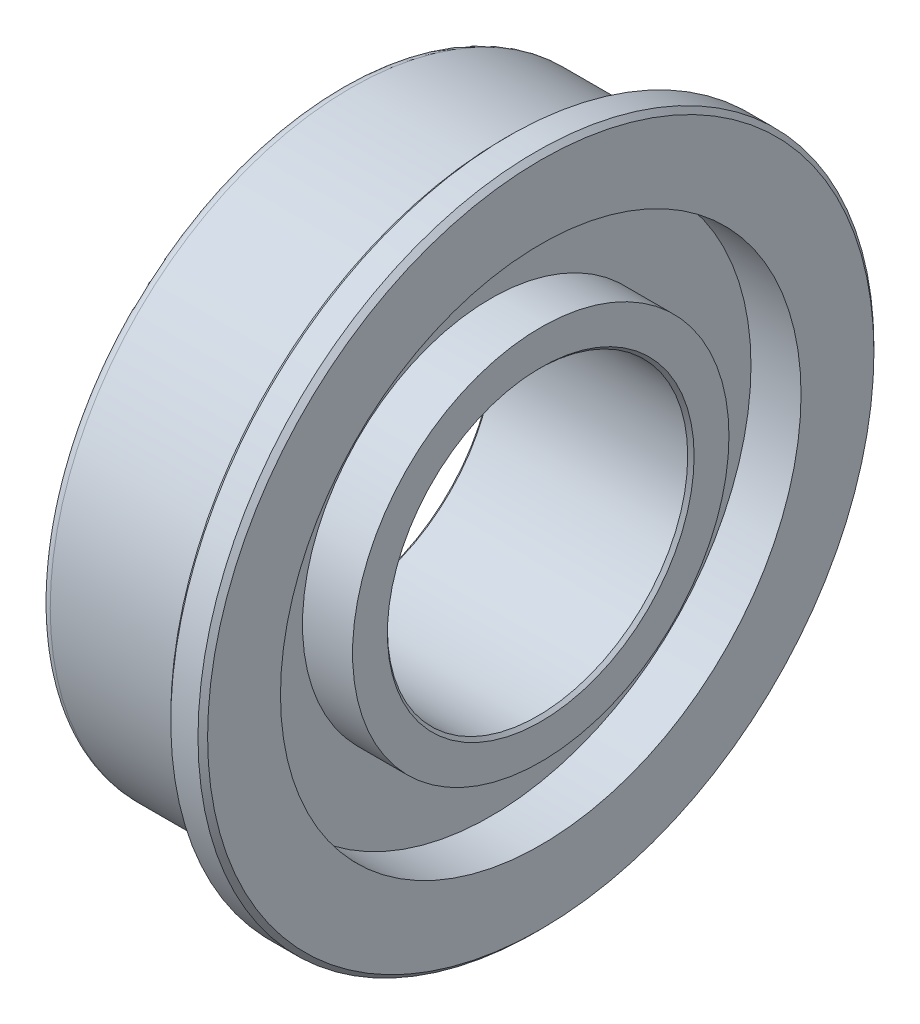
ISO-10303-21;
HEADER;
FILE_DESCRIPTION(('STEP AP214'),'2;1');
FILE_NAME('part.step','',(''),(''),'','','');
FILE_SCHEMA(('AUTOMOTIVE_DESIGN { 1 0 10303 214 1 1 1 1 }'));
ENDSEC;
DATA;
#1=APPLICATION_CONTEXT('core data for automotive mechanical design processes');
#2=APPLICATION_PROTOCOL_DEFINITION('international standard','automotive_design',2000,#1);
#3=PRODUCT_CONTEXT('',#1,'mechanical');
#4=PRODUCT('Part','Part','',(#3));
#5=PRODUCT_RELATED_PRODUCT_CATEGORY('part','',(#4));
#6=PRODUCT_DEFINITION_FORMATION('','',#4);
#7=PRODUCT_DEFINITION_CONTEXT('part definition',#1,'design');
#8=PRODUCT_DEFINITION('design','',#6,#7);
#9=PRODUCT_DEFINITION_SHAPE('','',#8);
#10=(LENGTH_UNIT() NAMED_UNIT(*) SI_UNIT(.MILLI.,.METRE.));
#11=(NAMED_UNIT(*) PLANE_ANGLE_UNIT() SI_UNIT($,.RADIAN.));
#12=(NAMED_UNIT(*) SI_UNIT($,.STERADIAN.) SOLID_ANGLE_UNIT());
#13=UNCERTAINTY_MEASURE_WITH_UNIT(LENGTH_MEASURE(1.E-05),#10,'distance_accuracy_value','');
#14=(GEOMETRIC_REPRESENTATION_CONTEXT(3) GLOBAL_UNCERTAINTY_ASSIGNED_CONTEXT((#13)) GLOBAL_UNIT_ASSIGNED_CONTEXT((#10,
#11,#12)) REPRESENTATION_CONTEXT('',''));
#15=CARTESIAN_POINT('',(0.,0.,0.));
#16=DIRECTION('',(0.,0.,1.));
#17=DIRECTION('',(1.,0.,0.));
#18=AXIS2_PLACEMENT_3D('',#15,#16,#17);
#19=CARTESIAN_POINT('',(1.5875,0.,0.));
#20=DIRECTION('',(1.,0.,0.));
#21=DIRECTION('',(0.,0.,-0.999999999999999));
#22=AXIS2_PLACEMENT_3D('',#19,#20,#21);
#23=PLANE('',#22);
#24=CARTESIAN_POINT('',(1.5875,0.,0.));
#25=DIRECTION('',(1.,0.,0.));
#26=DIRECTION('',(0.,0.,-0.999999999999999));
#27=AXIS2_PLACEMENT_3D('',#24,#25,#26);
#28=CIRCLE('',#27,2.43204999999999);
#29=CARTESIAN_POINT('',(1.5875,0.,-2.43204999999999));
#30=VERTEX_POINT('',#29);
#31=EDGE_CURVE('E155',#30,#30,#28,.F.);
#32=ORIENTED_EDGE('',*,*,#31,.T.);
#33=EDGE_LOOP('',(#32));
#34=FACE_BOUND('',#33,.T.);
#35=CARTESIAN_POINT('',(1.5875,0.,0.));
#36=DIRECTION('',(1.,0.,0.));
#37=DIRECTION('',(0.,0.,-0.999999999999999));
#38=AXIS2_PLACEMENT_3D('',#35,#36,#37);
#39=CIRCLE('',#38,2.9845);
#40=CARTESIAN_POINT('',(1.5875,0.,-2.9845));
#41=VERTEX_POINT('',#40);
#42=EDGE_CURVE('E152',#41,#41,#39,.F.);
#43=ORIENTED_EDGE('',*,*,#42,.F.);
#44=EDGE_LOOP('',(#43));
#45=FACE_BOUND('',#44,.T.);
#46=ADVANCED_FACE('F16',(#34,#45),#23,.T.);
#47=CARTESIAN_POINT('',(1.5875,0.,0.));
#48=DIRECTION('',(1.,0.,0.));
#49=DIRECTION('',(0.,0.,-0.999999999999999));
#50=AXIS2_PLACEMENT_3D('',#47,#48,#49);
#51=CONICAL_SURFACE('',#50,2.43204999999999,0.785398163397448);
#52=ORIENTED_EDGE('',*,*,#31,.F.);
#53=EDGE_LOOP('',(#52));
#54=FACE_BOUND('',#53,.T.);
#55=CARTESIAN_POINT('',(1.5367,0.,0.));
#56=DIRECTION('',(1.,0.,0.));
#57=DIRECTION('',(0.,0.,-0.999999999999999));
#58=AXIS2_PLACEMENT_3D('',#55,#56,#57);
#59=CIRCLE('',#58,2.38125);
#60=CARTESIAN_POINT('',(1.5367,0.,-2.38125));
#61=VERTEX_POINT('',#60);
#62=EDGE_CURVE('E111',#61,#61,#59,.F.);
#63=ORIENTED_EDGE('',*,*,#62,.T.);
#64=EDGE_LOOP('',(#63));
#65=FACE_BOUND('',#64,.T.);
#66=ADVANCED_FACE('F163',(#54,#65),#51,.F.);
#67=CARTESIAN_POINT('',(-1.74625,0.,0.));
#68=DIRECTION('',(1.,0.,0.));
#69=DIRECTION('',(0.,0.,-0.999999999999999));
#70=AXIS2_PLACEMENT_3D('',#67,#68,#69);
#71=CYLINDRICAL_SURFACE('',#70,2.9845);
#72=CARTESIAN_POINT('',(0.793749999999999,0.,0.));
#73=DIRECTION('',(1.,0.,0.));
#74=DIRECTION('',(0.,0.,-0.999999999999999));
#75=AXIS2_PLACEMENT_3D('',#72,#73,#74);
#76=CIRCLE('',#75,2.9845);
#77=CARTESIAN_POINT('',(0.79375,0.,-2.9845));
#78=VERTEX_POINT('',#77);
#79=EDGE_CURVE('E149',#78,#78,#76,.F.);
#80=ORIENTED_EDGE('',*,*,#79,.F.);
#81=EDGE_LOOP('',(#80));
#82=FACE_BOUND('',#81,.T.);
#83=ORIENTED_EDGE('',*,*,#42,.T.);
#84=EDGE_LOOP('',(#83));
#85=FACE_BOUND('',#84,.T.);
#86=ADVANCED_FACE('F166',(#82,#85),#71,.T.);
#87=CARTESIAN_POINT('',(-1.74625,0.,0.));
#88=DIRECTION('',(1.,0.,0.));
#89=DIRECTION('',(0.,0.,-0.999999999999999));
#90=AXIS2_PLACEMENT_3D('',#87,#88,#89);
#91=CYLINDRICAL_SURFACE('',#90,2.38125);
#92=ORIENTED_EDGE('',*,*,#62,.F.);
#93=EDGE_LOOP('',(#92));
#94=FACE_BOUND('',#93,.T.);
#95=CARTESIAN_POINT('',(-1.5367,0.,0.));
#96=DIRECTION('',(-1.,0.,0.));
#97=DIRECTION('',(0.,-0.999999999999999,0.));
#98=AXIS2_PLACEMENT_3D('',#95,#96,#97);
#99=CIRCLE('',#98,2.38124999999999);
#100=CARTESIAN_POINT('',(-1.5367,-2.38125000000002,0.));
#101=VERTEX_POINT('',#100);
#102=EDGE_CURVE('E148',#101,#101,#99,.T.);
#103=ORIENTED_EDGE('',*,*,#102,.T.);
#104=EDGE_LOOP('',(#103));
#105=FACE_BOUND('',#104,.T.);
#106=ADVANCED_FACE('F181',(#94,#105),#91,.F.);
#107=CARTESIAN_POINT('',(0.793749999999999,0.,0.));
#108=DIRECTION('',(1.,0.,0.));
#109=DIRECTION('',(0.,0.,-0.999999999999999));
#110=AXIS2_PLACEMENT_3D('',#107,#108,#109);
#111=PLANE('',#110);
#112=ORIENTED_EDGE('',*,*,#79,.T.);
#113=EDGE_LOOP('',(#112));
#114=FACE_BOUND('',#113,.T.);
#115=CARTESIAN_POINT('',(0.793749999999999,0.,0.));
#116=DIRECTION('',(1.,0.,0.));
#117=DIRECTION('',(0.,0.,-0.999999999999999));
#118=AXIS2_PLACEMENT_3D('',#115,#116,#117);
#119=CIRCLE('',#118,4.1275);
#120=CARTESIAN_POINT('',(0.79375,0.,-4.1275));
#121=VERTEX_POINT('',#120);
#122=EDGE_CURVE('E145',#121,#121,#119,.T.);
#123=ORIENTED_EDGE('',*,*,#122,.T.);
#124=EDGE_LOOP('',(#123));
#125=FACE_BOUND('',#124,.T.);
#126=ADVANCED_FACE('F187',(#114,#125),#111,.T.);
#127=CARTESIAN_POINT('',(-1.5875,0.,0.));
#128=DIRECTION('',(-1.,0.,0.));
#129=DIRECTION('',(0.,0.,0.999999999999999));
#130=AXIS2_PLACEMENT_3D('',#127,#128,#129);
#131=CONICAL_SURFACE('',#130,2.43204999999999,0.785398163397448);
#132=ORIENTED_EDGE('',*,*,#102,.F.);
#133=EDGE_LOOP('',(#132));
#134=FACE_BOUND('',#133,.T.);
#135=CARTESIAN_POINT('',(-1.5875,0.,0.));
#136=DIRECTION('',(-1.,0.,0.));
#137=DIRECTION('',(0.,0.,0.999999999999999));
#138=AXIS2_PLACEMENT_3D('',#135,#136,#137);
#139=CIRCLE('',#138,2.43204999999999);
#140=CARTESIAN_POINT('',(-1.5875,0.,2.43204999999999));
#141=VERTEX_POINT('',#140);
#142=EDGE_CURVE('E141',#141,#141,#139,.T.);
#143=ORIENTED_EDGE('',*,*,#142,.T.);
#144=EDGE_LOOP('',(#143));
#145=FACE_BOUND('',#144,.T.);
#146=ADVANCED_FACE('F183',(#134,#145),#131,.F.);
#147=CARTESIAN_POINT('',(-1.74625,0.,0.));
#148=DIRECTION('',(1.,0.,0.));
#149=DIRECTION('',(0.,0.,-0.999999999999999));
#150=AXIS2_PLACEMENT_3D('',#147,#148,#149);
#151=CYLINDRICAL_SURFACE('',#150,4.1275);
#152=CARTESIAN_POINT('',(1.5875,0.,0.));
#153=DIRECTION('',(1.,0.,0.));
#154=DIRECTION('',(0.,0.,-0.999999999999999));
#155=AXIS2_PLACEMENT_3D('',#152,#153,#154);
#156=CIRCLE('',#155,4.1275);
#157=CARTESIAN_POINT('',(1.5875,0.,-4.1275));
#158=VERTEX_POINT('',#157);
#159=EDGE_CURVE('E137',#158,#158,#156,.F.);
#160=ORIENTED_EDGE('',*,*,#159,.F.);
#161=EDGE_LOOP('',(#160));
#162=FACE_BOUND('',#161,.T.);
#163=ORIENTED_EDGE('',*,*,#122,.F.);
#164=EDGE_LOOP('',(#163));
#165=FACE_BOUND('',#164,.T.);
#166=ADVANCED_FACE('F186',(#162,#165),#151,.F.);
#167=CARTESIAN_POINT('',(-1.5875,0.,0.));
#168=DIRECTION('',(1.,0.,0.));
#169=DIRECTION('',(0.,0.,-0.999999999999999));
#170=AXIS2_PLACEMENT_3D('',#167,#168,#169);
#171=PLANE('',#170);
#172=ORIENTED_EDGE('',*,*,#142,.F.);
#173=EDGE_LOOP('',(#172));
#174=FACE_BOUND('',#173,.T.);
#175=CARTESIAN_POINT('',(-1.5875,0.,0.));
#176=DIRECTION('',(1.,0.,0.));
#177=DIRECTION('',(0.,0.,-0.999999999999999));
#178=AXIS2_PLACEMENT_3D('',#175,#176,#177);
#179=CIRCLE('',#178,2.9845);
#180=CARTESIAN_POINT('',(-1.5875,0.,-2.9845));
#181=VERTEX_POINT('',#180);
#182=EDGE_CURVE('E133',#181,#181,#179,.T.);
#183=ORIENTED_EDGE('',*,*,#182,.F.);
#184=EDGE_LOOP('',(#183));
#185=FACE_BOUND('',#184,.T.);
#186=ADVANCED_FACE('F191',(#174,#185),#171,.F.);
#187=CARTESIAN_POINT('',(1.5875,0.,0.));
#188=DIRECTION('',(1.,0.,0.));
#189=DIRECTION('',(0.,0.,-0.999999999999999));
#190=AXIS2_PLACEMENT_3D('',#187,#188,#189);
#191=PLANE('',#190);
#192=ORIENTED_EDGE('',*,*,#159,.T.);
#193=EDGE_LOOP('',(#192));
#194=FACE_BOUND('',#193,.T.);
#195=CARTESIAN_POINT('',(1.5875,0.,0.));
#196=DIRECTION('',(-1.,0.,0.));
#197=DIRECTION('',(0.,0.,0.999999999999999));
#198=AXIS2_PLACEMENT_3D('',#195,#196,#197);
#199=CIRCLE('',#198,5.2832);
#200=CARTESIAN_POINT('',(1.5875,0.,5.2832));
#201=VERTEX_POINT('',#200);
#202=EDGE_CURVE('E129',#201,#201,#199,.T.);
#203=ORIENTED_EDGE('',*,*,#202,.F.);
#204=EDGE_LOOP('',(#203));
#205=FACE_BOUND('',#204,.T.);
#206=ADVANCED_FACE('F194',(#194,#205),#191,.T.);
#207=CARTESIAN_POINT('',(-1.74625,0.,0.));
#208=DIRECTION('',(1.,0.,0.));
#209=DIRECTION('',(0.,0.,-0.999999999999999));
#210=AXIS2_PLACEMENT_3D('',#207,#208,#209);
#211=CYLINDRICAL_SURFACE('',#210,2.9845);
#212=ORIENTED_EDGE('',*,*,#182,.T.);
#213=EDGE_LOOP('',(#212));
#214=FACE_BOUND('',#213,.T.);
#215=CARTESIAN_POINT('',(-0.793749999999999,0.,0.));
#216=DIRECTION('',(1.,0.,0.));
#217=DIRECTION('',(0.,0.,-0.999999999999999));
#218=AXIS2_PLACEMENT_3D('',#215,#216,#217);
#219=CIRCLE('',#218,2.9845);
#220=CARTESIAN_POINT('',(-0.793749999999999,0.,-2.9845));
#221=VERTEX_POINT('',#220);
#222=EDGE_CURVE('E125',#221,#221,#219,.F.);
#223=ORIENTED_EDGE('',*,*,#222,.T.);
#224=EDGE_LOOP('',(#223));
#225=FACE_BOUND('',#224,.T.);
#226=ADVANCED_FACE('F198',(#214,#225),#211,.T.);
#227=CARTESIAN_POINT('',(1.5113,0.,0.));
#228=DIRECTION('',(-1.,0.,0.));
#229=DIRECTION('',(0.,0.,0.999999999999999));
#230=AXIS2_PLACEMENT_3D('',#227,#228,#229);
#231=CONICAL_SURFACE('',#230,5.3594,0.785398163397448);
#232=ORIENTED_EDGE('',*,*,#202,.T.);
#233=EDGE_LOOP('',(#232));
#234=FACE_BOUND('',#233,.T.);
#235=CARTESIAN_POINT('',(1.5113,0.,0.));
#236=DIRECTION('',(1.,0.,0.));
#237=DIRECTION('',(0.,0.,-0.999999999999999));
#238=AXIS2_PLACEMENT_3D('',#235,#236,#237);
#239=CIRCLE('',#238,5.3594);
#240=CARTESIAN_POINT('',(1.5113,0.,-5.3594));
#241=VERTEX_POINT('',#240);
#242=EDGE_CURVE('E124',#241,#241,#239,.F.);
#243=ORIENTED_EDGE('',*,*,#242,.F.);
#244=EDGE_LOOP('',(#243));
#245=FACE_BOUND('',#244,.T.);
#246=ADVANCED_FACE('F201',(#234,#245),#231,.T.);
#247=CARTESIAN_POINT('',(-0.79375,0.,0.));
#248=DIRECTION('',(1.,0.,0.));
#249=DIRECTION('',(0.,0.,-0.999999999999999));
#250=AXIS2_PLACEMENT_3D('',#247,#248,#249);
#251=PLANE('',#250);
#252=ORIENTED_EDGE('',*,*,#222,.F.);
#253=EDGE_LOOP('',(#252));
#254=FACE_BOUND('',#253,.T.);
#255=CARTESIAN_POINT('',(-0.793749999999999,0.,0.));
#256=DIRECTION('',(1.,0.,0.));
#257=DIRECTION('',(0.,0.,-0.999999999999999));
#258=AXIS2_PLACEMENT_3D('',#255,#256,#257);
#259=CIRCLE('',#258,4.1275);
#260=CARTESIAN_POINT('',(-0.793749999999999,0.,-4.1275));
#261=VERTEX_POINT('',#260);
#262=EDGE_CURVE('E120',#261,#261,#259,.F.);
#263=ORIENTED_EDGE('',*,*,#262,.T.);
#264=EDGE_LOOP('',(#263));
#265=FACE_BOUND('',#264,.T.);
#266=ADVANCED_FACE('F205',(#254,#265),#251,.F.);
#267=CARTESIAN_POINT('',(-1.74625,0.,0.));
#268=DIRECTION('',(1.,0.,0.));
#269=DIRECTION('',(0.,0.,-0.999999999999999));
#270=AXIS2_PLACEMENT_3D('',#267,#268,#269);
#271=CYLINDRICAL_SURFACE('',#270,5.3594);
#272=ORIENTED_EDGE('',*,*,#242,.T.);
#273=EDGE_LOOP('',(#272));
#274=FACE_BOUND('',#273,.T.);
#275=CARTESIAN_POINT('',(1.0795,0.,0.));
#276=DIRECTION('',(1.,0.,0.));
#277=DIRECTION('',(0.,-0.999999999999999,0.));
#278=AXIS2_PLACEMENT_3D('',#275,#276,#277);
#279=CIRCLE('',#278,5.3594);
#280=CARTESIAN_POINT('',(1.0795,-5.35940000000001,0.));
#281=VERTEX_POINT('',#280);
#282=EDGE_CURVE('E119',#281,#281,#279,.F.);
#283=ORIENTED_EDGE('',*,*,#282,.F.);
#284=EDGE_LOOP('',(#283));
#285=FACE_BOUND('',#284,.T.);
#286=ADVANCED_FACE('F208',(#274,#285),#271,.T.);
#287=CARTESIAN_POINT('',(-1.74625,0.,0.));
#288=DIRECTION('',(1.,0.,0.));
#289=DIRECTION('',(0.,0.,-0.999999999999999));
#290=AXIS2_PLACEMENT_3D('',#287,#288,#289);
#291=CYLINDRICAL_SURFACE('',#290,4.1275);
#292=ORIENTED_EDGE('',*,*,#262,.F.);
#293=EDGE_LOOP('',(#292));
#294=FACE_BOUND('',#293,.T.);
#295=CARTESIAN_POINT('',(-1.5875,0.,0.));
#296=DIRECTION('',(1.,0.,0.));
#297=DIRECTION('',(0.,0.,-0.999999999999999));
#298=AXIS2_PLACEMENT_3D('',#295,#296,#297);
#299=CIRCLE('',#298,4.1275);
#300=CARTESIAN_POINT('',(-1.5875,0.,-4.1275));
#301=VERTEX_POINT('',#300);
#302=EDGE_CURVE('E47',#301,#301,#299,.F.);
#303=ORIENTED_EDGE('',*,*,#302,.T.);
#304=EDGE_LOOP('',(#303));
#305=FACE_BOUND('',#304,.T.);
#306=ADVANCED_FACE('F212',(#294,#305),#291,.F.);
#307=CARTESIAN_POINT('',(1.0795,0.,0.));
#308=DIRECTION('',(1.,0.,0.));
#309=DIRECTION('',(0.,0.,-0.999999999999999));
#310=AXIS2_PLACEMENT_3D('',#307,#308,#309);
#311=CONICAL_SURFACE('',#310,5.35939999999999,0.785398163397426);
#312=ORIENTED_EDGE('',*,*,#282,.T.);
#313=EDGE_LOOP('',(#312));
#314=FACE_BOUND('',#313,.T.);
#315=CARTESIAN_POINT('',(1.0033,0.,0.));
#316=DIRECTION('',(1.,0.,0.));
#317=DIRECTION('',(0.,0.,-0.999999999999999));
#318=AXIS2_PLACEMENT_3D('',#315,#316,#317);
#319=CIRCLE('',#318,5.2832);
#320=CARTESIAN_POINT('',(1.0033,0.,-5.28319999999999));
#321=VERTEX_POINT('',#320);
#322=EDGE_CURVE('E46',#321,#321,#319,.T.);
#323=ORIENTED_EDGE('',*,*,#322,.T.);
#324=EDGE_LOOP('',(#323));
#325=FACE_BOUND('',#324,.T.);
#326=ADVANCED_FACE('F69',(#314,#325),#311,.T.);
#327=CARTESIAN_POINT('',(-1.5875,0.,0.));
#328=DIRECTION('',(1.,0.,0.));
#329=DIRECTION('',(0.,0.,-0.999999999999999));
#330=AXIS2_PLACEMENT_3D('',#327,#328,#329);
#331=PLANE('',#330);
#332=ORIENTED_EDGE('',*,*,#302,.F.);
#333=EDGE_LOOP('',(#332));
#334=FACE_BOUND('',#333,.T.);
#335=CARTESIAN_POINT('',(-1.5875,0.,0.));
#336=DIRECTION('',(1.,0.,0.));
#337=DIRECTION('',(0.,-1.,0.));
#338=AXIS2_PLACEMENT_3D('',#335,#336,#337);
#339=CIRCLE('',#338,4.60374999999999);
#340=CARTESIAN_POINT('',(-1.5875,-4.60375000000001,0.));
#341=VERTEX_POINT('',#340);
#342=CARTESIAN_POINT('',(-1.5875,4.60374999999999,0.));
#343=VERTEX_POINT('',#342);
#344=EDGE_CURVE('E43',#341,#343,#339,.T.);
#345=ORIENTED_EDGE('',*,*,#344,.F.);
#346=CARTESIAN_POINT('',(-1.5875,0.,0.));
#347=DIRECTION('',(1.,0.,0.));
#348=DIRECTION('',(0.,1.,0.));
#349=AXIS2_PLACEMENT_3D('',#346,#347,#348);
#350=CIRCLE('',#349,4.60374999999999);
#351=EDGE_CURVE('E37',#343,#341,#350,.T.);
#352=ORIENTED_EDGE('',*,*,#351,.F.);
#353=EDGE_LOOP('',(#345,#352));
#354=FACE_BOUND('',#353,.T.);
#355=ADVANCED_FACE('F50',(#334,#354),#331,.F.);
#356=CARTESIAN_POINT('',(1.0033,0.,0.));
#357=DIRECTION('',(1.,0.,0.));
#358=DIRECTION('',(0.,0.,-0.999999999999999));
#359=AXIS2_PLACEMENT_3D('',#356,#357,#358);
#360=PLANE('',#359);
#361=CARTESIAN_POINT('',(1.0033,0.,0.));
#362=DIRECTION('',(1.,0.,0.));
#363=DIRECTION('',(0.,0.,-0.999999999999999));
#364=AXIS2_PLACEMENT_3D('',#361,#362,#363);
#365=CIRCLE('',#364,4.7625);
#366=CARTESIAN_POINT('',(1.0033,0.,-4.7625));
#367=VERTEX_POINT('',#366);
#368=EDGE_CURVE('E27',#367,#367,#365,.F.);
#369=ORIENTED_EDGE('',*,*,#368,.F.);
#370=EDGE_LOOP('',(#369));
#371=FACE_BOUND('',#370,.T.);
#372=ORIENTED_EDGE('',*,*,#322,.F.);
#373=EDGE_LOOP('',(#372));
#374=FACE_BOUND('',#373,.T.);
#375=ADVANCED_FACE('F68',(#371,#374),#360,.F.);
#376=CARTESIAN_POINT('',(-1.42875,0.,0.));
#377=DIRECTION('',(1.,0.,0.));
#378=DIRECTION('',(0.,-1.,0.));
#379=AXIS2_PLACEMENT_3D('',#376,#377,#378);
#380=TOROIDAL_SURFACE('',#379,4.60374999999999,0.15875);
#381=ORIENTED_EDGE('',*,*,#351,.T.);
#382=ORIENTED_EDGE('',*,*,#344,.T.);
#383=EDGE_LOOP('',(#381,#382));
#384=FACE_BOUND('',#383,.T.);
#385=CARTESIAN_POINT('',(-1.42875,0.,0.));
#386=DIRECTION('',(1.,0.,0.));
#387=DIRECTION('',(0.,0.,-0.999999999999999));
#388=AXIS2_PLACEMENT_3D('',#385,#386,#387);
#389=CIRCLE('',#388,4.7625);
#390=CARTESIAN_POINT('',(-1.42875,0.,-4.7625));
#391=VERTEX_POINT('',#390);
#392=EDGE_CURVE('E11',#391,#391,#389,.T.);
#393=ORIENTED_EDGE('',*,*,#392,.F.);
#394=EDGE_LOOP('',(#393));
#395=FACE_BOUND('',#394,.T.);
#396=ADVANCED_FACE('F41',(#384,#395),#380,.T.);
#397=CARTESIAN_POINT('',(-1.74625,0.,0.));
#398=DIRECTION('',(1.,0.,0.));
#399=DIRECTION('',(0.,0.,-0.999999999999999));
#400=AXIS2_PLACEMENT_3D('',#397,#398,#399);
#401=CYLINDRICAL_SURFACE('',#400,4.7625);
#402=ORIENTED_EDGE('',*,*,#392,.T.);
#403=EDGE_LOOP('',(#402));
#404=FACE_BOUND('',#403,.T.);
#405=ORIENTED_EDGE('',*,*,#368,.T.);
#406=EDGE_LOOP('',(#405));
#407=FACE_BOUND('',#406,.T.);
#408=ADVANCED_FACE('F92',(#404,#407),#401,.T.);
#409=CLOSED_SHELL('',(#46,#66,#86,#106,#126,#146,#166,#186,#206,#226,#246,#266,#286,#306,#326,
#355,#375,#396,#408));
#410=MANIFOLD_SOLID_BREP('B1',#409);
#411=ADVANCED_BREP_SHAPE_REPRESENTATION('',(#18,#410),#14);
#412=SHAPE_DEFINITION_REPRESENTATION(#9,#411);
ENDSEC;
END-ISO-10303-21;
